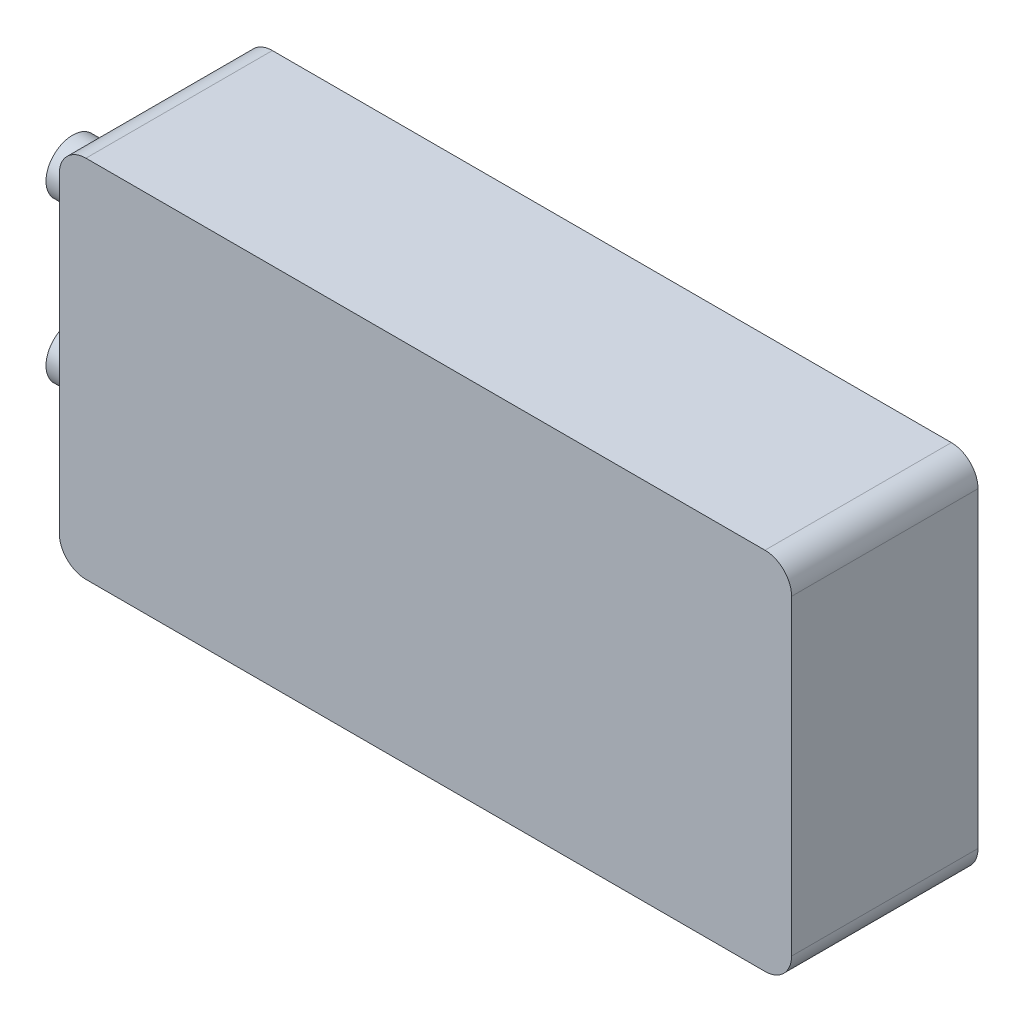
from build123d import *

# Parameters (mm, degrees)
SKETCH1_W           = 69.85
SKETCH1_H           = 34.798
BOSS_EXTRUDE1_DEPTH = 17.78
FILLET1_R           = 2.54
SKETCH2_R           = 2.54
BOSS_EXTRUDE2_DEPTH = 7.62


with BuildPart() as part:
    # Sketch1 → Boss-Extrude1 (new body)
    with BuildSketch(Plane.XY):
        Rectangle(SKETCH1_W, SKETCH1_H)
    extrude(amount=BOSS_EXTRUDE1_DEPTH)

    # Fillet1
    fillet1_edges = [part.edges().sort_by_distance(p)[0] for p in [
        (34.925, -17.399, 8.89),
        (-34.925, -17.399, 8.89),
        (-34.925, 17.399, 8.89),
        (34.925, 17.399, 8.89),
    ]]
    fillet(fillet1_edges, radius=FILLET1_R)

    # Sketch2 → Boss-Extrude2 (add)
    with BuildSketch(Plane.ZY.offset(34.925)):
        with Locations(Location((8.89, 7.239, 0), (0, 0, 180))):
            Circle(SKETCH2_R)
        with Locations(Location((8.89, -8.001, 0), (0, 0, 180))):
            Circle(SKETCH2_R)
    extrude(amount=BOSS_EXTRUDE2_DEPTH)


solid = part.part
